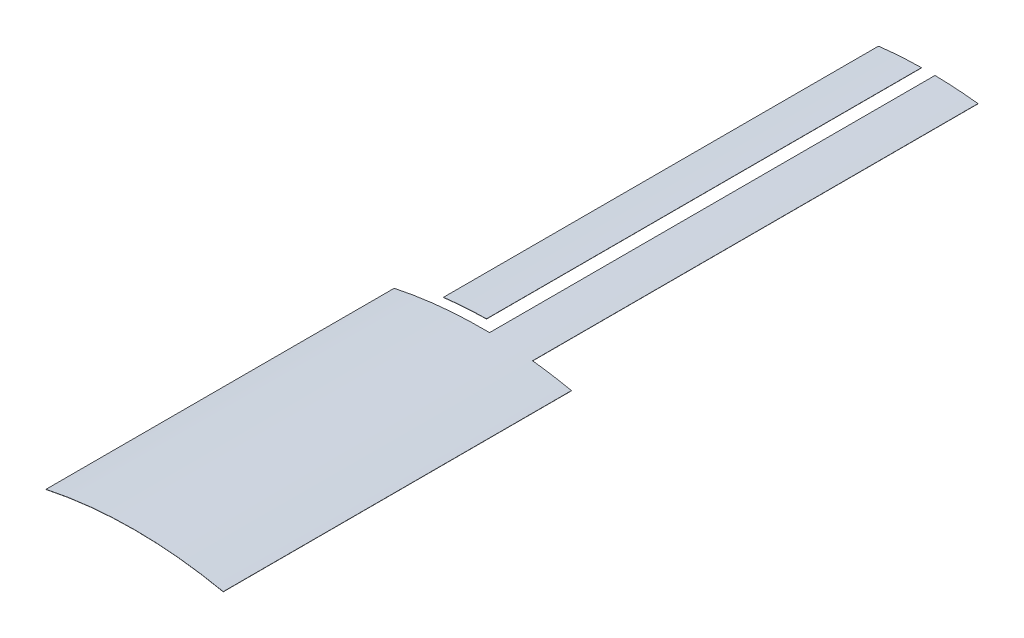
from build123d import *

# Parameters (mm, degrees)
EXTRUDE1_DEPTH     = 50.8
SKETCH2_W          = 2.712722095
SKETCH2_H          = 27.46371292
CUT_EXTRUDE2_DEPTH = 50.8


with BuildPart() as part:
    # Sketch1 → Extrude1 (new body)
    with BuildSketch(Plane.XY):
        with BuildLine():
            Line((-6.35, 26.099117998), (-6.35, 26.086047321))
            ThreePointArc((-6.35, 26.086047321), (0, 26.8478), (6.35, 26.086047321))
            Line((6.35, 26.086047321), (6.35, 26.099117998))
            ThreePointArc((6.35, 26.099117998), (0, 26.8605), (-6.35, 26.099117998))
        make_face()
    extrude(amount=EXTRUDE1_DEPTH)

    # Sketch2 → Cut-Extrude2 (cut)
    with BuildSketch(Plane(origin=(0, 0, 0), x_dir=(1, 0, 0), z_dir=(0, 1, 0))):
        Polygon((6.35, -50.8), (6.35, -28.084580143), (3.665419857, -25.4), (3.665419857, 0), (3.137407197, 1.044174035), (-3.409554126, 1.044174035), (-3.665419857, 0), (-3.665419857, -25.4), (-6.35, -28.084580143), (-6.35, -50.8), align=None)
        Polygon((3.137407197, -28.084580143), (5.588, -28.084580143), (5.588, -50.038), (-5.588, -50.038), (-5.588, -28.084580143), (0.424685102, -28.084580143), (0.424685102, 0.038787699), (3.137407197, 0.038787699), align=None, mode=Mode.SUBTRACT)
        with Locations((-1.78104615, -13.693068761)):
            Rectangle(SKETCH2_W, SKETCH2_H, mode=Mode.SUBTRACT)
    extrude(amount=CUT_EXTRUDE2_DEPTH, mode=Mode.SUBTRACT)


with BuildPart() as cut_extrude2_piece_1:
    # of the separate pieces the step leaves, piece 1, a body of its own (cut_extrude2_pieces_kept)
    add(part.part.solids().sort_by_distance((0.424685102, 26.844440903, 0))[0])


with BuildPart() as cut_extrude2_piece_2:
    # of the separate pieces the step leaves, piece 2, a body of its own (cut_extrude2_pieces_kept)
    add(part.part.solids().sort_by_distance((-0.424685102, 26.857142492, 0))[0])


solid = Compound([cut_extrude2_piece_1.part, cut_extrude2_piece_2.part])
